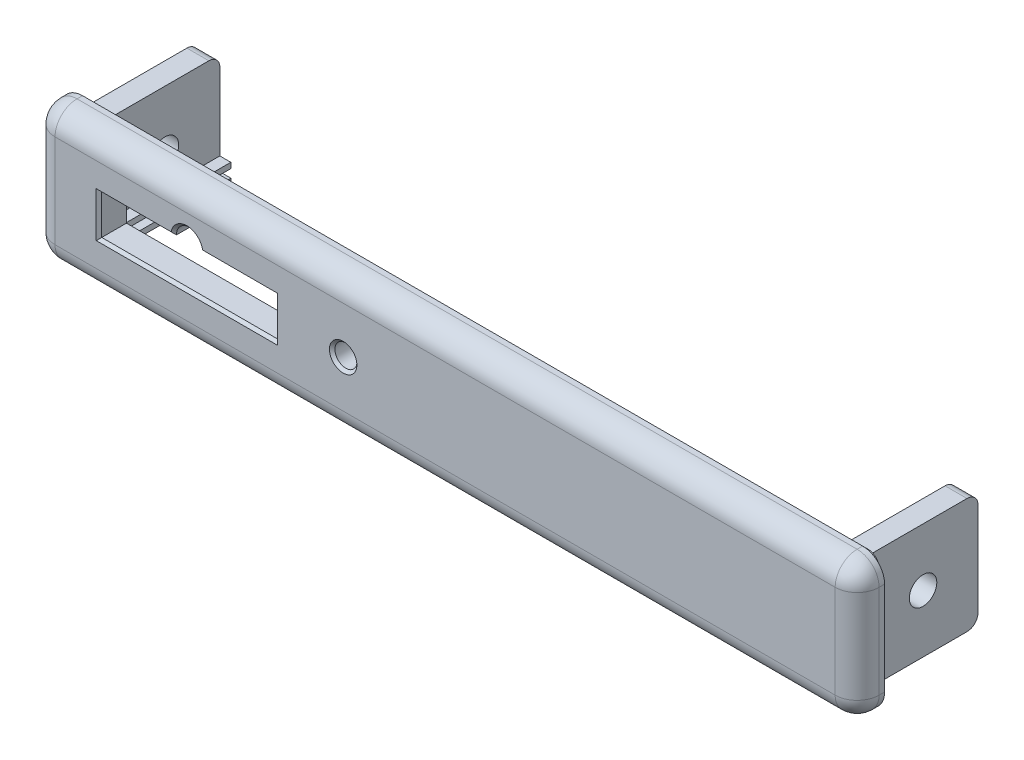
from build123d import *

# Parameters (mm, degrees)
SKIZZE1_W                            = 75
SKIZZE1_H                            = 12.5
LINEAR_AUSTRAGEN1_DEPTH              = 3
SKIZZE3_W                            = 10
SKIZZE3_H                            = 10.5
LINEAR_AUSTRAGEN2_DEPTH              = 4
SKIZZE4_W                            = 10
SKIZZE4_H                            = 10.5
LINEAR_AUSTRAGEN3_DEPTH              = 4
VERRUNDUNG1_R                        = 2
SKIZZE6_W                            = 5
SKIZZE6_H                            = 12
SCHNITT_LINEAR_AUSTRAGEN1_DEPTH      = 10
SKIZZE7_W                            = 5
SKIZZE7_H                            = 19.178537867
SCHNITT_LINEAR_AUSTRAGEN2_DEPTH      = 10
SKIZZE8_R                            = 1.25
SCHNITT_LINEAR_AUSTRAGEN3_DEPTH      = 75.35724578
SKIZZE11_W                           = 67
SKIZZE11_H                           = 1.75
LINEAR_AUSTRAGEN4_DEPTH              = 10
SKIZZE13_W                           = 67
SKIZZE13_H                           = 0.75
SCHNITT_LINEAR_AUSTRAGEN4_DEPTH      = 10
SCHNITT_LINEAR_AUSTRAGEN5_DEPTH      = 10
VERRUNDUNG2_R                        = 1
VERRUNDUNG3_R                        = 1
VERRUNDUNG4_R                        = 1
VERRUNDUNG5_R                        = 1
SKIZZE15_W                           = 16
SKIZZE15_H                           = 3.6
SCHNITT_LINEAR_AUSTRAGEN6_DEPTH      = 41.929817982
SKIZZE16_R                           = 1
SCHNITT_LINEAR_AUSTRAGEN7_DEPTH      = 41.929817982
FASE1_SIZE                           = 0.25
SCHNITT_LINEAR_AUSTRAGEN8_DEPTH      = 41.929817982
SCHNITT_LINEAR_AUSTRAGEN8_DEPTH_BACK = 41.929817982
FASE2_SIZE                           = 0.25
SKIZZE18_W                           = 77
SKIZZE18_H                           = 14.5
SCHNITT_LINEAR_AUSTRAGEN9_DEPTH      = 0.5
SCHNITT_LINEAR_AUSTRAGEN10_DEPTH     = 0.5


with BuildPart() as part:
    # Skizze1 → Linear austragen1 (new body)
    with BuildSketch(Plane.XY):
        with Locations((0, -3.75)):
            Rectangle(SKIZZE1_W, SKIZZE1_H)
    extrude(amount=LINEAR_AUSTRAGEN1_DEPTH)

    # Skizze3 → Linear austragen2 (add)
    with BuildSketch(Plane(origin=(37.5, 0, 0), x_dir=(0, 0, -1), z_dir=(1, 0, 0))):
        with Locations((5, -3.75)):
            Rectangle(SKIZZE3_W, SKIZZE3_H)
    extrude(amount=-LINEAR_AUSTRAGEN2_DEPTH)

    # Skizze4 → Linear austragen3 (add)
    with BuildSketch(Plane.ZY.offset(37.5)):
        with Locations((-5, -3.75)):
            Rectangle(SKIZZE4_W, SKIZZE4_H)
    extrude(amount=-LINEAR_AUSTRAGEN3_DEPTH)

    # Verrundung1
    verrundung1_edges = [part.edges().sort_by_distance(p)[0] for p in [
        (0, 2.5, 3),
        (37.5, -3.75, 3),
        (0, -10, 3),
        (-37.5, -3.75, 3),
        (-37.5, -10, 1.5),
        (-37.5, 2.5, 1.5),
        (37.5, -10, 1.5),
        (37.5, 2.5, 1.5),
    ]]
    fillet(verrundung1_edges, radius=VERRUNDUNG1_R)

    # Skizze6 → Schnitt-Linear austragen1 (cut)
    with BuildSketch(Plane(origin=(0, 0, -10), x_dir=(-1, 0, 0), z_dir=(0, 0, -1))):
        with Locations((-38, -3)):
            Rectangle(SKIZZE6_W, SKIZZE6_H)
    extrude(amount=-SCHNITT_LINEAR_AUSTRAGEN1_DEPTH, mode=Mode.SUBTRACT)

    # Skizze7 → Schnitt-Linear austragen2 (cut)
    with BuildSketch(Plane(origin=(0, 0, -10), x_dir=(-1, 0, 0), z_dir=(0, 0, -1))):
        with Locations((38, -0.225890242)):
            Rectangle(SKIZZE7_W, SKIZZE7_H)
    extrude(amount=-SCHNITT_LINEAR_AUSTRAGEN2_DEPTH, mode=Mode.SUBTRACT)

    # Skizze8 → Schnitt-Linear austragen3 (cut, through all)
    with BuildSketch(Plane(origin=(35.5, 0, 0), x_dir=(0, 0, -1), z_dir=(1, 0, 0))):
        with Locations((5, -3.75)):
            Circle(SKIZZE8_R)
    extrude(amount=-SCHNITT_LINEAR_AUSTRAGEN3_DEPTH, mode=Mode.SUBTRACT)

    # Skizze11 → Linear austragen4 (add)
    with BuildSketch(Plane(origin=(0, 0, -10), x_dir=(-1, 0, 0), z_dir=(0, 0, -1))):
        with Locations((0, -7.375)):
            Rectangle(SKIZZE11_W, SKIZZE11_H)
    extrude(amount=-LINEAR_AUSTRAGEN4_DEPTH)

    # Skizze13 → Schnitt-Linear austragen4 (cut)
    with BuildSketch(Plane(origin=(0, 0, -10), x_dir=(-1, 0, 0), z_dir=(0, 0, -1))):
        with Locations((0, -7.375)):
            Rectangle(SKIZZE13_W, SKIZZE13_H)
    extrude(amount=-SCHNITT_LINEAR_AUSTRAGEN4_DEPTH, mode=Mode.SUBTRACT)

    # Skizze14 → Schnitt-Linear austragen5 (cut)
    with BuildSketch(Plane(origin=(0, 0, -10), x_dir=(-1, 0, 0), z_dir=(0, 0, -1))):
        Polygon((-32.5, -2.25), (32.5, -1), (32.5, -10.25), (-32.5, -10.25), align=None)
    extrude(amount=-SCHNITT_LINEAR_AUSTRAGEN5_DEPTH, mode=Mode.SUBTRACT)

    # Verrundung2
    verrundung2_edges = [part.edges().sort_by_distance(p)[0] for p in [
        (34.5, 1.5, -10),
    ]]
    fillet(verrundung2_edges, radius=VERRUNDUNG2_R)

    # Verrundung3
    verrundung3_edges = [part.edges().sort_by_distance(p)[0] for p in [
        (34.5, -9, -10),
    ]]
    fillet(verrundung3_edges, radius=VERRUNDUNG3_R)

    # Verrundung4
    verrundung4_edges = [part.edges().sort_by_distance(p)[0] for p in [
        (-34.5, 1.5, -10),
    ]]
    fillet(verrundung4_edges, radius=VERRUNDUNG4_R)

    # Verrundung5
    verrundung5_edges = [part.edges().sort_by_distance(p)[0] for p in [
        (-34.5, -9, -10),
    ]]
    fillet(verrundung5_edges, radius=VERRUNDUNG5_R)

    # Skizze15 → Schnitt-Linear austragen6 (cut, through all)
    with BuildSketch(Plane.XY.offset(3)):
        with Locations((-23.5, -3.75)):
            Rectangle(SKIZZE15_W, SKIZZE15_H)
    extrude(amount=-SCHNITT_LINEAR_AUSTRAGEN6_DEPTH, mode=Mode.SUBTRACT)

    # Skizze16 → Schnitt-Linear austragen7 (cut, through all)
    with BuildSketch(Plane.XY.offset(3)):
        with Locations((-9.277815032, -3.75)):
            Circle(SKIZZE16_R)
    extrude(amount=-SCHNITT_LINEAR_AUSTRAGEN7_DEPTH, mode=Mode.SUBTRACT)

    # Fase1
    fase1_edges = [part.edges().sort_by_distance(p)[0] for p in [
        (-10.277815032, -3.75, 3),
    ]]
    chamfer(fase1_edges, length=FASE1_SIZE)

    # Skizze17 → Schnitt-Linear austragen8 (cut, two sides: drawn at the far end of the back side and taken through both)
    with BuildSketch(Plane.XY.offset(3).offset(-SCHNITT_LINEAR_AUSTRAGEN8_DEPTH_BACK)):
        with BuildLine():
            Line((-24.7, -1.95), (-22.3, -1.95))
            ThreePointArc((-22.3, -1.95), (-23.5, -0.75), (-24.7, -1.95))
        make_face()
    extrude(amount=SCHNITT_LINEAR_AUSTRAGEN8_DEPTH + SCHNITT_LINEAR_AUSTRAGEN8_DEPTH_BACK, mode=Mode.SUBTRACT)

    # Fase2
    fase2_edges = [part.edges().sort_by_distance(p)[0] for p in [
        (-31.5, -3.75, 3),
        (-23.5, -5.55, 3),
        (-15.5, -3.75, 3),
        (-18.9, -1.95, 3),
        (-28.1, -1.95, 3),
        (-23.5, -0.75, 3),
    ]]
    chamfer(fase2_edges, length=FASE2_SIZE)

    # Skizze18 → Schnitt-Linear austragen9 (cut)
    with BuildSketch(Plane(origin=(0, 0, 0), x_dir=(-1, 0, 0), z_dir=(0, 0, -1))):
        with Locations((0, -3.75)):
            Rectangle(SKIZZE18_W, SKIZZE18_H)
        with BuildLine():
            Line((-35.5, 2), (35.5, 2))
            ThreePointArc((35.5, 2), (36.207106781, 1.707106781), (36.5, 1))
            Line((36.5, 1), (36.5, -8.5))
            ThreePointArc((36.5, -8.5), (36.207106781, -9.207106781), (35.5, -9.5))
            Line((35.5, -9.5), (-35.5, -9.5))
            ThreePointArc((-35.5, -9.5), (-36.207106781, -9.207106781), (-36.5, -8.5))
            Line((-36.5, -8.5), (-36.5, 1))
            ThreePointArc((-36.5, 1), (-36.207106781, 1.707106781), (-35.5, 2))
        make_face(mode=Mode.SUBTRACT)
    extrude(amount=-SCHNITT_LINEAR_AUSTRAGEN9_DEPTH, mode=Mode.SUBTRACT)

    # Skizze19 → Schnitt-Linear austragen10 (cut)
    with BuildSketch(Plane(origin=(0, 0, 0), x_dir=(-1, 0, 0), z_dir=(0, 0, -1))):
        with BuildLine():
            Line((15.5, -0.05), (31.5, -0.05))
            ThreePointArc((31.5, -0.05), (32.207106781, -0.342893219), (32.5, -1.05))
            Line((32.5, -1.05), (32.5, -5.55))
            ThreePointArc((32.5, -5.55), (32.207106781, -6.257106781), (31.5, -6.55))
            Line((31.5, -6.55), (15.5, -6.55))
            ThreePointArc((15.5, -6.55), (14.792893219, -6.257106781), (14.5, -5.55))
            Line((14.5, -5.55), (14.5, -1.05))
            ThreePointArc((14.5, -1.05), (14.792893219, -0.342893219), (15.5, -0.05))
        make_face()
    extrude(amount=-SCHNITT_LINEAR_AUSTRAGEN10_DEPTH, mode=Mode.SUBTRACT)


solid = part.part
